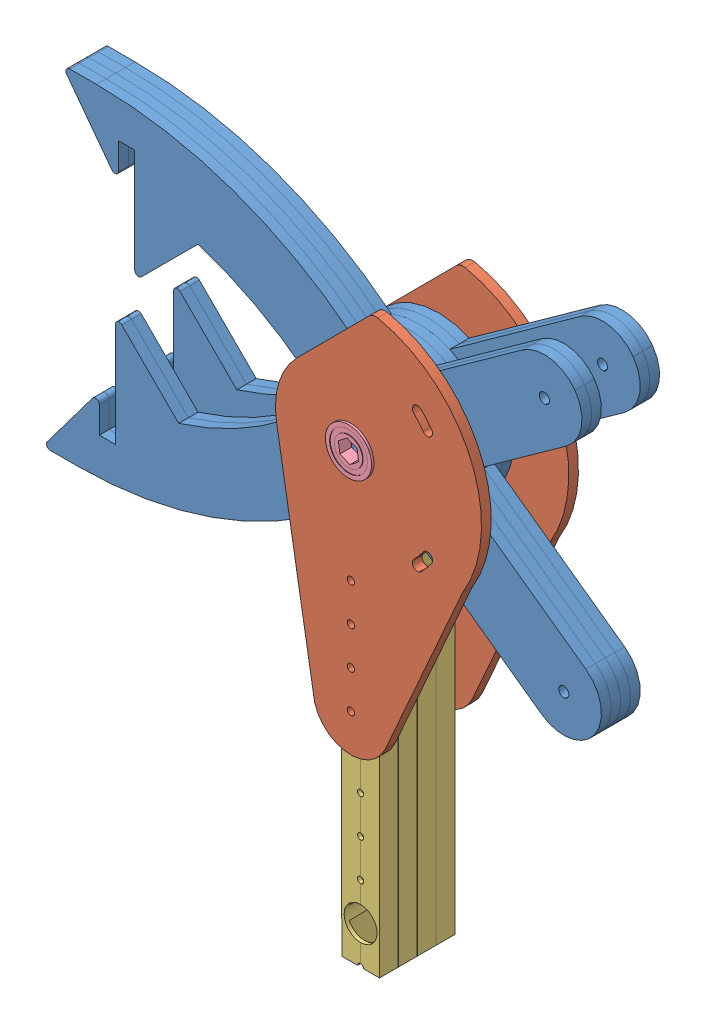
SolidWorks assembly Moving Stabby Grabber.SLDASM, configuration Default (file format 10000). Lengths in mm.
Overall size (384.06 704.82 68.45).
13 component instances, 4 part files, 35 mates.
Components (placement in the parent):
- INSIDE BOTTOM Claw Arm-1: INSIDE BOTTOM Claw Arm.SLDPRT [Default] at (183.9782 210.5264 281.0535) x (1 0 0) z (0 -1 0) size (360.64 6.53 222.25)
- INSIDE BOTTOM Claw Arm-2: INSIDE BOTTOM Claw Arm.SLDPRT [Default] at (183.9782 210.5264 287.5813) x (1 0 0) z (0 -1 0) size (360.64 6.53 222.25)
- INSIDE BOTTOM Claw Arm-3: INSIDE BOTTOM Claw Arm.SLDPRT [Default] at (183.9782 210.5264 300.6369) x (1 0.00016 0) z (-0.00016 1 0) size (360.64 6.53 222.25)
- INSIDE BOTTOM Claw Arm-4: INSIDE BOTTOM Claw Arm.SLDPRT [Default] at (183.9782 210.5264 267.9979) x (1 0.00016 0) z (-0.00016 1 0) size (360.64 6.53 222.25)
- INSIDE BOTTOM Claw Arm-5: INSIDE BOTTOM Claw Arm.SLDPRT [Default] at (183.9782 210.5264 274.5257) x (1 0 0) z (0 -1 0) size (360.64 6.53 222.25)
- INSIDE BOTTOM Claw Arm-6: INSIDE BOTTOM Claw Arm.SLDPRT [Default] at (183.9782 210.5264 267.9979) x (1 0 0) z (0 -1 0) size (360.64 6.53 222.25)
- Stabby Grabber Stabilizer Plate-1: Stabby Grabber Stabilizer Plate.SLDPRT [Default] at (183.9782 210.5264 307.1647) x (0 0 1) z (-1 -0.00016 0) size (6.53 264.03 138.79)
- Stabby Grabber Stabilizer Plate-2: Stabby Grabber Stabilizer Plate.SLDPRT [Default] at (183.9782 210.5264 248.4145) x (0 0 1) z (-1 -0.00016 0) size (6.53 264.03 138.79)
- 11p5 2x1 claw stick-1: 11p5 2x1 claw stick.SLDPRT [Default] at (184.1083 -602.2736 281.7647) x (-1 -0.00016 0) z (-0.00016 1 0) size (25.4 50.8 241.3)
- INSIDE BOTTOM Claw Arm-7: INSIDE BOTTOM Claw Arm.SLDPRT [Default] at (183.9782 210.5264 307.1647) x (1 0.00016 0) z (-0.00016 1 0) size (360.64 6.53 222.25)
- INSIDE BOTTOM Claw Arm-9: INSIDE BOTTOM Claw Arm.SLDPRT [Default] at (183.9782 210.5264 261.4701) x (1 0.00016 0) z (-0.00016 1 0) size (360.64 6.53 222.25)
- 0.5 Hex ID 1.125OD Bearing R6 VEX-217-2734-1: 0.5 Hex ID 1.125OD Bearing R6 VEX-217-2734.SLDPRT [Default] at (183.9782 210.5264 254.7645) x (-0.923728 -0.383049 0) z (0.383049 -0.923728 0) size (31.12 7.94 31.12)
- 0.5 Hex ID 1.125OD Bearing R6 VEX-217-2734-2: 0.5 Hex ID 1.125OD Bearing R6 VEX-217-2734.SLDPRT [Default] at (183.9782 210.5264 307.3425) x (-0.923728 0.383049 0) z (0.383049 0.923728 0) size (31.12 7.94 31.12)
Mates (geometry in assembly coordinates):
- Concentric2: concentric anti-aligned: cylinder of INSIDE BOTTOM Claw Arm-4 through (183.9782 210.5264 261.4701) axis (0 0 1) radius 7.493; cylinder of INSIDE BOTTOM Claw Arm-6 through (183.9782 210.5264 274.5257) axis (0 0 -1) radius 7.493
- Concentric3: concentric aligned: cylinder of INSIDE BOTTOM Claw Arm-5 through (183.9782 210.5264 281.0535) axis (0 0 -1) radius 7.493; cylinder of INSIDE BOTTOM Claw Arm-6 through (183.9782 210.5264 274.5257) axis (0 0 -1) radius 7.493
- Concentric4: concentric aligned: cylinder of INSIDE BOTTOM Claw Arm-1 through (183.9782 210.5264 287.5813) axis (0 0 -1) radius 7.493; cylinder of INSIDE BOTTOM Claw Arm-5 through (183.9782 210.5264 281.0535) axis (0 0 -1) radius 7.493
- Concentric5: concentric aligned: cylinder of INSIDE BOTTOM Claw Arm-1 through (183.9782 210.5264 287.5813) axis (0 0 -1) radius 7.493; cylinder of INSIDE BOTTOM Claw Arm-2 through (183.9782 210.5264 294.1091) axis (0 0 -1) radius 7.493
- Concentric6: concentric anti-aligned: cylinder of INSIDE BOTTOM Claw Arm-2 through (183.9782 210.5264 294.1091) axis (0 0 -1) radius 7.493; cylinder of INSIDE BOTTOM Claw Arm-3 through (183.9782 210.5264 294.1091) axis (0 0 1) radius 7.493
- Coincident2: coincident anti-aligned: plane of INSIDE BOTTOM Claw Arm-4 through (-6.9645 378.2661 267.9979) normal (0 0 1); plane of INSIDE BOTTOM Claw Arm-6 through (-6.9376 42.7561 267.9979) normal (0 0 -1)
- Coincident3: coincident anti-aligned: plane of INSIDE BOTTOM Claw Arm-5 through (-6.9376 42.7561 274.5257) normal (0 0 -1); plane of INSIDE BOTTOM Claw Arm-6 through (-6.9376 42.7561 274.5257) normal (0 0 1)
- Coincident4: coincident anti-aligned: plane of INSIDE BOTTOM Claw Arm-1 through (-6.9376 42.7561 281.0535) normal (0 0 -1); plane of INSIDE BOTTOM Claw Arm-5 through (-6.9376 42.7561 281.0535) normal (0 0 1)
- Coincident5: coincident anti-aligned: plane of INSIDE BOTTOM Claw Arm-1 through (-6.9376 42.7561 287.5813) normal (0 0 1); plane of INSIDE BOTTOM Claw Arm-2 through (-6.9376 42.7561 287.5813) normal (0 0 -1)
- Coincident6: coincident anti-aligned: plane of INSIDE BOTTOM Claw Arm-2 through (-6.9376 42.7561 294.1091) normal (0 0 1); plane of INSIDE BOTTOM Claw Arm-3 through (-6.9645 378.2661 294.1091) normal (0 0 -1)
- Coincident9: coincident aligned: plane of INSIDE BOTTOM Claw Arm-3 through (204.8876 256.8237 294.1091) normal (-0.583463 0.812139 0); plane of INSIDE BOTTOM Claw Arm-4 through (204.8876 256.8237 261.4701) normal (-0.583463 0.812139 0)
- Concentric12: concentric anti-aligned: cylinder of INSIDE BOTTOM Claw Arm-3 through (183.9782 210.5264 294.1091) axis (0 0 1) radius 7.493; cylinder of Stabby Grabber Stabilizer Plate-1 through (183.9782 210.5264 313.6925) axis (0 0 -1) radius 14.2875
- Slot2: slot aligned: cylinder of Stabby Grabber Stabilizer Plate-1 through (183.9782 210.5264 313.6925) axis (0 0 -1) radius 66.929; cylinder of INSIDE BOTTOM Claw Arm-2 through (235.555 173.4847 294.1091) axis (0 0 -1) radius 3.429; cylinder of Stabby Grabber Stabilizer Plate-1 through (235.5609 173.493 313.6925) axis (0 0 -1) radius 3.429
- Coincident12: coincident aligned: plane of INSIDE BOTTOM Claw Arm-5 through (343.2099 127.4404 281.0535) normal (0.583333 0.812233 0); plane of INSIDE BOTTOM Claw Arm-6 through (343.2099 127.4404 274.5257) normal (0.583333 0.812233 0)
- Coincident13: coincident aligned: plane of INSIDE BOTTOM Claw Arm-1 through (343.2099 127.4404 287.5813) normal (0.583333 0.812233 0); plane of INSIDE BOTTOM Claw Arm-5 through (343.2099 127.4404 281.0535) normal (0.583333 0.812233 0)
- Coincident14: coincident aligned: plane of INSIDE BOTTOM Claw Arm-1 through (343.2099 127.4404 287.5813) normal (0.583333 0.812233 0); plane of INSIDE BOTTOM Claw Arm-2 through (343.2099 127.4404 294.1091) normal (0.583333 0.812233 0)
- Concentric13: concentric anti-aligned: cylinder of INSIDE BOTTOM Claw Arm-4 through (183.9782 210.5264 261.4701) axis (0 0 1) radius 7.493; cylinder of Stabby Grabber Stabilizer Plate-2 through (183.9782 210.5264 254.9423) axis (0 0 -1) radius 14.2875
- Coincident16: coincident aligned: plane of Stabby Grabber Stabilizer Plate-1 through (207.2201 47.8254 313.6925) normal (0.914073 -0.40555 0); plane of Stabby Grabber Stabilizer Plate-2 through (207.2201 47.8254 254.9423) normal (0.914073 -0.40555 0)
- Coincident17: coincident aligned: plane of Stabby Grabber Stabilizer Plate-1 through (145.8195 132.0138 313.6925) normal (-0.985802 -0.16791 0); plane of Stabby Grabber Stabilizer Plate-2 through (145.8195 132.0138 254.9423) normal (-0.985802 -0.16791 0)
- Coincident18: coincident anti-aligned: plane of Stabby Grabber Stabilizer Plate-1 through (183.9782 210.5264 307.1647) normal (0 0 -1); plane of 11p5 2x1 claw stick-1 through (196.6884 147.0284 307.1647) normal (0 0 1)
- Slot4: slot anti-aligned: cylinder of INSIDE BOTTOM Claw Arm-3 through (235.5491 247.5763 294.1091) axis (0 0 1) radius 3.429; cylinder of Stabby Grabber Stabilizer Plate-1 through (183.9782 210.5264 313.6925) axis (0 0 -1) radius 60.071; cylinder of Stabby Grabber Stabilizer Plate-1 through (228.7943 255.5127 313.6925) axis (0 0 -1) radius 3.429
- Concentric20: concentric aligned: cylinder of Stabby Grabber Stabilizer Plate-1 through (183.9904 134.3264 313.6925) axis (0 0 1) radius 2.4574; cylinder of 11p5 2x1 claw stick-1 through (183.9904 134.3264 256.3647) axis (0 0 1) radius 2.0701
- Concentric21: concentric aligned: cylinder of Stabby Grabber Stabilizer Plate-1 through (184.0026 58.1264 313.6925) axis (0 0 1) radius 2.4574; cylinder of 11p5 2x1 claw stick-1 through (184.0026 58.1264 256.3647) axis (0 0 1) radius 2.0701
- Coincident31: coincident anti-aligned: plane of INSIDE BOTTOM Claw Arm-3 through (-6.9645 378.2661 300.6369) normal (0 0 1); plane of INSIDE BOTTOM Claw Arm-7 through (-6.9645 378.2661 300.6369) normal (0 0 -1)
- Coincident32: coincident anti-aligned: plane of Stabby Grabber Stabilizer Plate-1 through (183.9782 210.5264 307.1647) normal (0 0 -1); plane of INSIDE BOTTOM Claw Arm-7 through (-6.9645 378.2661 307.1647) normal (0 0 1)
- Coincident33: coincident aligned: plane of INSIDE BOTTOM Claw Arm-3 through (18.886 161.5323 294.1091) normal (-1 -0.00016 0); plane of INSIDE BOTTOM Claw Arm-7 through (18.886 161.5323 300.6369) normal (-1 -0.00016 0)
- Coincident34: coincident aligned: plane of INSIDE BOTTOM Claw Arm-3 through (18.8792 204.15 294.1091) normal (0.706994 0.70722 0); plane of INSIDE BOTTOM Claw Arm-7 through (18.8792 204.15 300.6369) normal (0.706994 0.70722 0)
- Coincident35: coincident anti-aligned: plane of INSIDE BOTTOM Claw Arm-4 through (-6.9645 378.2661 261.4701) normal (0 0 -1); plane of INSIDE BOTTOM Claw Arm-9 through (-6.9645 378.2661 261.4701) normal (0 0 1)
- Coincident36: coincident anti-aligned: plane of Stabby Grabber Stabilizer Plate-2 through (183.9782 210.5264 254.9423) normal (0 0 1); plane of INSIDE BOTTOM Claw Arm-9 through (-6.9645 378.2661 254.9423) normal (0 0 -1)
- Coincident37: coincident aligned: plane of INSIDE BOTTOM Claw Arm-4 through (204.8876 256.8237 261.4701) normal (-0.583463 0.812139 0); plane of INSIDE BOTTOM Claw Arm-9 through (204.8876 256.8237 254.9423) normal (-0.583463 0.812139 0)
- Coincident38: coincident aligned: plane of INSIDE BOTTOM Claw Arm-4 through (18.8792 204.15 261.4701) normal (0.706994 0.70722 0); plane of INSIDE BOTTOM Claw Arm-9 through (18.8792 204.15 254.9423) normal (0.706994 0.70722 0)
- Concentric30: concentric aligned: cylinder of Stabby Grabber Stabilizer Plate-2 through (183.9782 210.5264 254.9423) axis (0 0 -1) radius 14.2875; cylinder of 0.5 Hex ID 1.125OD Bearing R6 VEX-217-2734-1 through (183.9782 210.5264 254.7645) axis (0 0 -1) radius 14.2748
- Coincident39: coincident anti-aligned: plane of Stabby Grabber Stabilizer Plate-2 through (183.9782 210.5264 248.4145) normal (0 0 -1); plane of 0.5 Hex ID 1.125OD Bearing R6 VEX-217-2734-1 through (169.6073 204.5671 248.4145) normal (0 0 1)
- Coincident40: coincident anti-aligned: plane of Stabby Grabber Stabilizer Plate-1 through (183.9782 210.5264 313.6925) normal (0 0 1); plane of 0.5 Hex ID 1.125OD Bearing R6 VEX-217-2734-2 through (169.6073 216.4857 313.6925) normal (0 0 -1)
- Concentric31: concentric anti-aligned: cylinder of Stabby Grabber Stabilizer Plate-1 through (183.9782 210.5264 313.6925) axis (0 0 -1) radius 14.2875; cylinder of 0.5 Hex ID 1.125OD Bearing R6 VEX-217-2734-2 through (183.9782 210.5264 307.3425) axis (0 0 1) radius 14.2748
